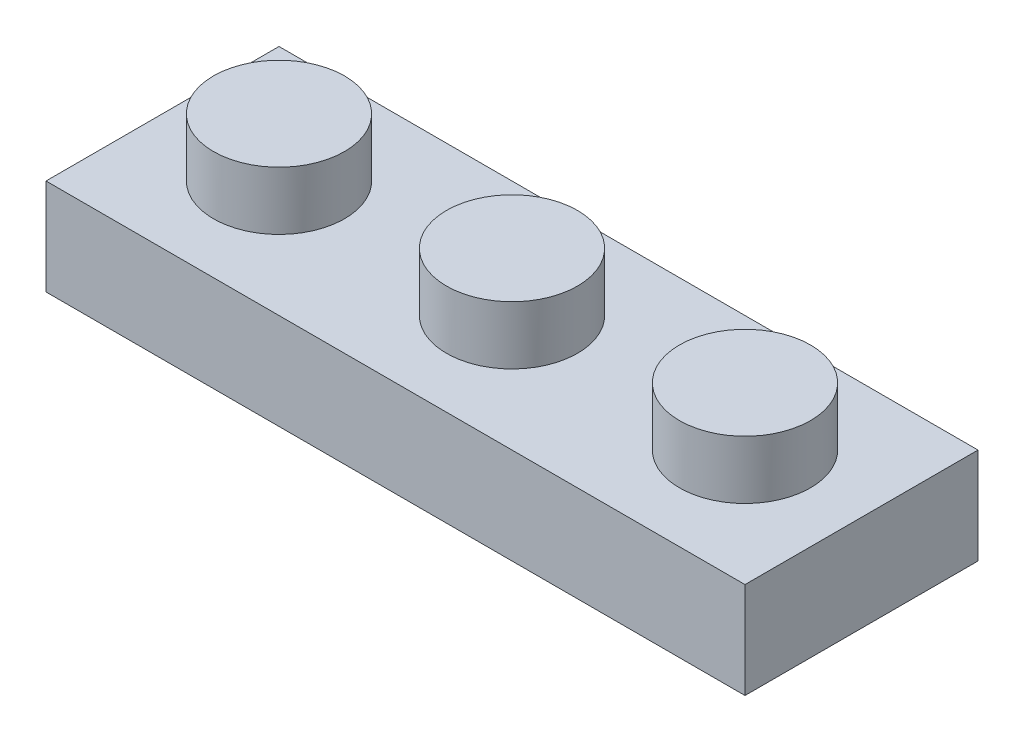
from build123d import *

# Parameters (mm, degrees)
SKETCH1_W       = 24
SKETCH1_H       = 8
EXTRUDE1_DEPTH  = 3.3
SKETCH2_R       = 2.25
EXTRUDE2_DEPTH  = 2
SKETCH3_W       = 4.5
SKETCH3_H       = 4.5
EXTRUDE3_DEPTH  = 2.5
LPATTERN1_COUNT = 4
LPATTERN1_PITCH = 8
LPATTERN2_COUNT = 4
LPATTERN2_PITCH = 8


with BuildPart() as part:
    # Sketch1 → Extrude1 (new body)
    with BuildSketch(Plane(origin=(0, 0, 0), x_dir=(1, 0, 0), z_dir=(0, 1, 0))):
        with Locations((12, 4)):
            Rectangle(SKETCH1_W, SKETCH1_H)
    extrude(amount=EXTRUDE1_DEPTH)

    # Sketch2 → Extrude2 (add)
    with BuildSketch(Plane(origin=(0, 3.3, 0), x_dir=(1, 0, 0), z_dir=(0, 1, 0))):
        with Locations(Location((4, 4, 0), (0, 0, 90))):
            Circle(SKETCH2_R)
    extrude2 = extrude(amount=EXTRUDE2_DEPTH)

    # Sketch3 → Extrude3 (cut)
    with BuildSketch(Plane.XZ):
        with Locations((20, -4)):
            Rectangle(SKETCH3_W, SKETCH3_H)
    extrude3 = extrude(amount=-EXTRUDE3_DEPTH, mode=Mode.SUBTRACT)

    # LPattern1: Extrude2 ×4, 1 skipped
    with Locations(*[(i * LPATTERN1_PITCH, 0, 0) for i in range(1, LPATTERN1_COUNT) if i not in (3,)]):
        add(extrude2)

    # LPattern2: Extrude3 ×4
    with Locations(*[(-i * LPATTERN2_PITCH, 0, 0) for i in range(1, LPATTERN2_COUNT)]):
        add(extrude3, mode=Mode.SUBTRACT)


solid = part.part
